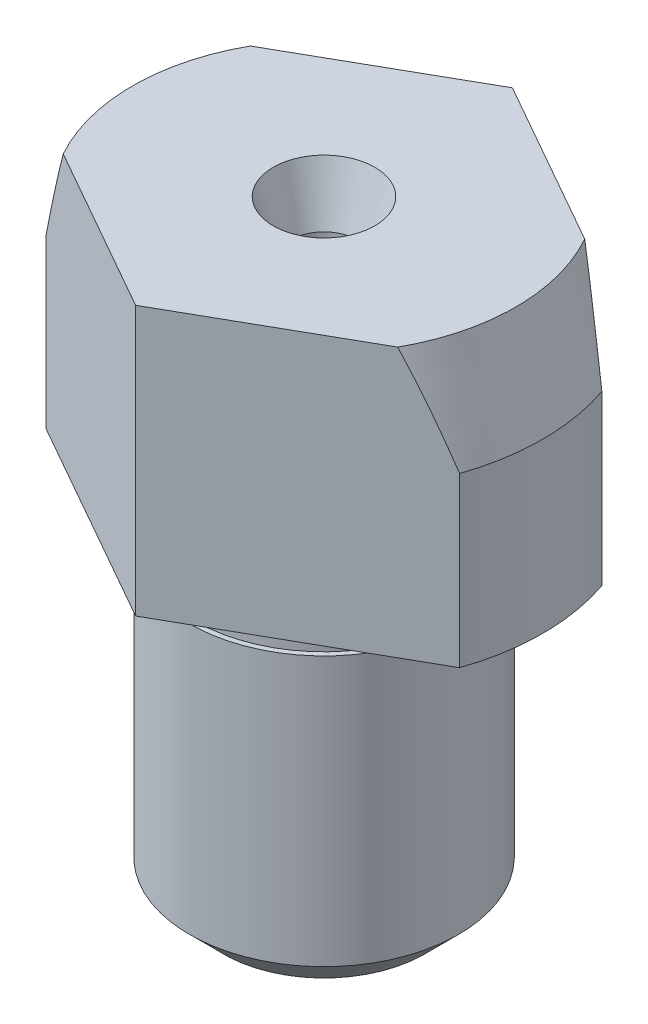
from build123d import *

# Parameters (mm, degrees)
ESQUISSE2_W             = 28
ESQUISSE2_H             = 28
ENL_V_MAT_EXTRU_1_DEPTH = 8.1


with BuildPart() as part:
    # Esquisse1 → R_volution1 (revolve)
    with BuildSketch(Plane(origin=(0, 0, 0), x_dir=(0, 0, -1), z_dir=(1, 0, 0))):
        Polygon((0, 4.2), (1, 4.777350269), (1, 6.383662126), (1.51, 8), (5.696152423, 8), (6.5, 5), (6.5, 0), (3.85, 0), (3.85, -1), (4, -1), (4, -9), (3, -10), (2.01, -10), (1, -8.383662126), (1, -6.777350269), (0, -6.2), align=None)
    revolve(axis=Axis((0, -6.2, 0), (0, 1, 0)))

    # Esquisse2 → Enl_v. mat.-Extru.1 (cut)
    with BuildSketch(Plane(origin=(0, 8, 0), x_dir=(-1, 0, 0), z_dir=(0, 1, 0))):
        Rectangle(ESQUISSE2_W, ESQUISSE2_H)
        Polygon((0, 5.6), (-9.87352483, 0), (0, -5.6), (9.87352483, 0), align=None, mode=Mode.SUBTRACT)
    extrude(amount=-ENL_V_MAT_EXTRU_1_DEPTH, mode=Mode.SUBTRACT)


solid = part.part
